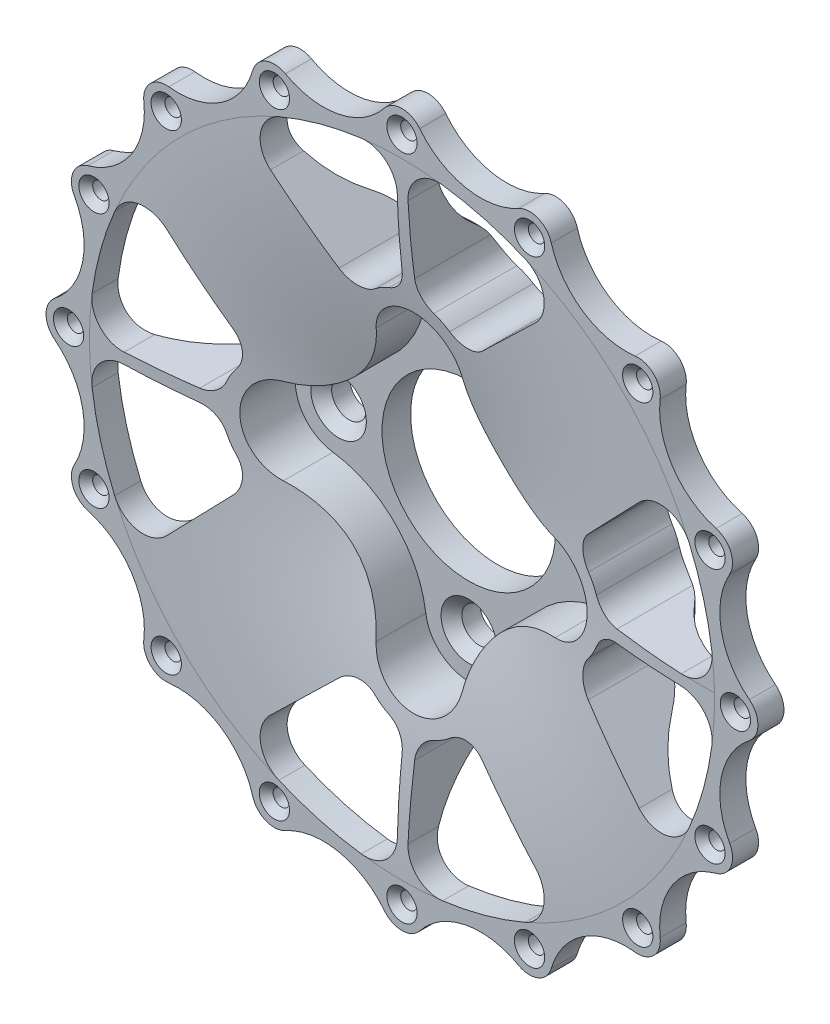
from build123d import *

# Parameters (mm, degrees)
SKETCH1_R          = 130.175
EXTRUDE1_DEPTH     = 25.4
SKETCH2_R          = 6.35
CUT_EXTRUDE1_DEPTH = 191.975656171
SKETCH4_R          = 3
CUT_EXTRUDE2_DEPTH = 76.2
CIRPATTERN1_COUNT  = 16
SKETCH7_R          = 31.75
CUT_EXTRUDE3_DEPTH = 191.975656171
CUT_EXTRUDE6_DEPTH = 40.3225
CUT_EXTRUDE7_DEPTH = 186.839234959
CIRPATTERN2_COUNT  = 4
CUT_EXTRUDE9_DEPTH = 188.378805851
CIRPATTERN4_COUNT  = 16
CHAMFER1_SIZE      = 2.54
CHAMFER2_SIZE      = 3.81


with BuildPart() as part:
    # Sketch1 → Extrude1 (new, symmetric)
    with BuildSketch(Plane.XY):
        Circle(SKETCH1_R)
    extrude(amount=EXTRUDE1_DEPTH, both=True)

    # Sketch2 → Cut-Extrude1 (cut, through all)
    with BuildSketch(Plane.XY.offset(25.4)):
        with Locations((0, 47.625)):
            Circle(SKETCH2_R)
        with Locations((47.625, 0)):
            Circle(SKETCH2_R)
        with Locations((-47.625, 0)):
            Circle(SKETCH2_R)
        with Locations((0, -47.625)):
            Circle(SKETCH2_R)
    extrude(amount=-CUT_EXTRUDE1_DEPTH, mode=Mode.SUBTRACT)

    # Sketch4 → Cut-Extrude2 (cut)
    with BuildSketch(Plane.XY.offset(25.4)):
        with Locations((0, 121.92)):
            Circle(SKETCH4_R)
    cut_extrude2 = extrude(amount=-CUT_EXTRUDE2_DEPTH, mode=Mode.SUBTRACT)

    # CirPattern1: Cut-Extrude2 ×16 about axis
    cirpattern1_axis = Axis((0, 0, 0), (0, 0, 1))
    for i in range(1, CIRPATTERN1_COUNT):
        add(cut_extrude2.rotate(cirpattern1_axis, i * 360 / CIRPATTERN1_COUNT), mode=Mode.SUBTRACT)

    # Sketch6 → Cut-Revolve1 (revolve, cut)
    with BuildSketch(Plane(origin=(0, 0, 0), x_dir=(0, 0, -1), z_dir=(1, 0, 0)), mode=Mode.PRIVATE) as cut_revolve1_sk:
        with BuildLine():
            Line((25.4, 60.325), (25.4, 130.175))
            Line((25.4, 130.175), (0, 130.175))
            Line((0, 130.175), (0, 114.3))
            ThreePointArc((0, 114.3), (3.928608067, 96.725227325), (14.966572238, 82.496033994))
            ThreePointArc((14.966572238, 82.496033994), (22.661306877, 72.576644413), (25.4, 60.325))
        make_face()
    revolve(cut_revolve1_sk.sketch.rotate(Axis((0, 0, 121.502865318), (0, 0, -1)), 90), axis=Axis((0, 0, 121.502865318), (0, 0, -1)), mode=Mode.SUBTRACT)

    # Sketch7 → Cut-Extrude3 (cut, through all)
    with BuildSketch(Plane.XY.offset(25.4)):
        Circle(SKETCH7_R)
    extrude(amount=-CUT_EXTRUDE3_DEPTH, mode=Mode.SUBTRACT)

    # Sketch8 → Cut-Extrude6 (cut)
    with BuildSketch(Plane.XY.offset(25.4)):
        with BuildLine():
            ThreePointArc((15.741331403, 49.680750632), (0, 63.5), (-15.741331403, 49.680750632))
            ThreePointArc((-15.741331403, 49.680750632), (-26.940768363, 26.940768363), (-49.680750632, 15.741331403))
            ThreePointArc((-49.680750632, 15.741331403), (-63.5, 0), (-49.680750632, -15.741331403))
            ThreePointArc((-49.680750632, -15.741331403), (-26.940768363, -26.940768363), (-15.741331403, -49.680750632))
            ThreePointArc((-15.741331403, -49.680750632), (0, -63.5), (15.741331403, -49.680750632))
            ThreePointArc((15.741331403, -49.680750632), (26.940768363, -26.940768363), (49.680750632, -15.741331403))
            ThreePointArc((49.680750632, -15.741331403), (63.5, 0), (49.680750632, 15.741331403))
            ThreePointArc((49.680750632, 15.741331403), (26.940768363, 26.940768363), (15.741331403, 49.680750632))
        make_face()
    extrude(amount=-CUT_EXTRUDE6_DEPTH, mode=Mode.SUBTRACT)

    # Sketch9 → Cut-Revolve2 (revolve, cut)
    with BuildSketch(Plane(origin=(0, 0, 0), x_dir=(0, 0, -1), z_dir=(1, 0, 0)), mode=Mode.PRIVATE) as cut_revolve2_sk:
        with BuildLine():
            Line((-9.525, 130.175), (-9.525, 114.3))
            ThreePointArc((-9.525, 114.3), (-6.524366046, 71.361282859), (2.419206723, 29.257248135))
            ThreePointArc((2.419206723, 29.257248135), (5.36250271, 15.400969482), (6.35, 1.27))
            Line((6.35, 1.27), (6.35, 0))
            Line((6.35, 0), (-25.4, 0))
            Line((-25.4, 0), (-25.4, 130.175))
            Line((-25.4, 130.175), (-9.525, 130.175))
        make_face()
    revolve(cut_revolve2_sk.sketch.rotate(Axis((0, 0, 121.502865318), (0, 0, -1)), 90), axis=Axis((0, 0, 121.502865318), (0, 0, -1)), mode=Mode.SUBTRACT)

    # Sketch10 → Cut-Extrude7 (cut, symmetric)
    with BuildSketch(Plane.XY):
        with BuildLine():
            Line((-1.95235798, 101.84634468), (-2.286955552, 76.286432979))
            ThreePointArc((-2.286955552, 76.286432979), (-3.935128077, 71.054426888), (-8.195484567, 67.599036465))
            ThreePointArc((-8.195484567, 67.599036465), (-11.031476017, 66.183950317), (-13.629733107, 64.368908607))
            ThreePointArc((-13.629733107, 64.368908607), (-20.046202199, 62.239471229), (-26.259471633, 64.904215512))
            Line((-26.259471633, 64.904215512), (-48.451692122, 86.334993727))
            ThreePointArc((-48.451692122, 86.334993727), (-51.753826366, 96.621157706), (-45.013052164, 105.063386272))
            ThreePointArc((-45.013052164, 105.063386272), (-30.224501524, 110.231436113), (-14.868198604, 113.328843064))
            ThreePointArc((-14.868198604, 113.328843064), (-5.7870531, 110.538272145), (-1.95235798, 101.84634468))
        make_face()
        with BuildLine():
            Line((1.95235798, 101.84634468), (2.286955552, 76.286432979))
            ThreePointArc((2.286955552, 76.286432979), (3.935128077, 71.054426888), (8.195484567, 67.599036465))
            ThreePointArc((8.195484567, 67.599036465), (11.031476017, 66.183950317), (13.629733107, 64.368908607))
            ThreePointArc((13.629733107, 64.368908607), (20.046202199, 62.239471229), (26.259471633, 64.904215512))
            Line((26.259471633, 64.904215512), (48.451692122, 86.334993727))
            ThreePointArc((48.451692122, 86.334993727), (51.753826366, 96.621157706), (45.013052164, 105.063386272))
            ThreePointArc((45.013052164, 105.063386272), (30.224501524, 110.231436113), (14.868198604, 113.328843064))
            ThreePointArc((14.868198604, 113.328843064), (5.7870531, 110.538272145), (1.95235798, 101.84634468))
        make_face()
    cut_extrude7 = extrude(amount=CUT_EXTRUDE7_DEPTH, both=True, mode=Mode.SUBTRACT)

    # CirPattern2: Cut-Extrude7 ×4 about axis
    cirpattern2_axis = Axis((0, 0, 0), (0, 0, 1))
    for i in range(1, CIRPATTERN2_COUNT):
        add(cut_extrude7.rotate(cirpattern2_axis, i * 360 / CIRPATTERN2_COUNT), mode=Mode.SUBTRACT)

    # Sketch12 → Cut-Extrude9 (cut, through all)
    with BuildSketch(Plane.XY.offset(9.525)):
        with BuildLine():
            ThreePointArc((6.480876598, 127.03304836), (3.601167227, 129.348096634), (0, 130.175))
            ThreePointArc((0, 130.175), (25.395882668, 127.673723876), (49.815815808, 120.266018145))
            ThreePointArc((49.815815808, 120.266018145), (46.172328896, 120.880166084), (42.625893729, 119.843357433))
            ThreePointArc((42.625893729, 119.843357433), (23.227941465, 116.774747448), (6.480876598, 127.03304836))
        make_face()
    cut_extrude9 = extrude(amount=-CUT_EXTRUDE9_DEPTH, mode=Mode.SUBTRACT)

    # CirPattern4: Cut-Extrude9 ×16 about axis
    cirpattern4_axis = Axis((0, 0, 0), (0, 0, 1))
    for i in range(1, CIRPATTERN4_COUNT):
        add(cut_extrude9.rotate(cirpattern4_axis, i * 360 / CIRPATTERN4_COUNT), mode=Mode.SUBTRACT)

    # Chamfer1
    chamfer1_edges = [part.edges().sort_by_distance(p)[0] for p in [
        (-3, 121.92, 9.525),
        (-49.428402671, 111.491342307, 9.525),
        (-88.331779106, 84.089138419, 9.525),
        (-113.787442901, 43.885125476, 9.525),
        (-121.92, -3, 9.525),
        (-111.491342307, -49.428402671, 9.525),
        (-84.089138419, -88.331779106, 9.525),
        (-43.885125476, -113.787442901, 9.525),
        (3, -121.92, 9.525),
        (49.428402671, -111.491342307, 9.525),
        (88.331779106, -84.089138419, 9.525),
        (113.787442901, -43.885125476, 9.525),
        (121.92, 3, 9.525),
        (111.491342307, 49.428402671, 9.525),
        (84.089138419, 88.331779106, 9.525),
        (43.885125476, 113.787442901, 9.525),
    ]]
    chamfer(chamfer1_edges, length=CHAMFER1_SIZE)

    # Chamfer2
    chamfer2_edges = [part.edges().sort_by_distance(p)[0] for p in [
        (-6.35, 47.625, -14.9225),
        (41.275, 0, -14.9225),
        (-53.975, 0, -14.9225),
        (-6.35, -47.625, -14.9225),
    ]]
    chamfer(chamfer2_edges, length=CHAMFER2_SIZE)


solid = part.part
